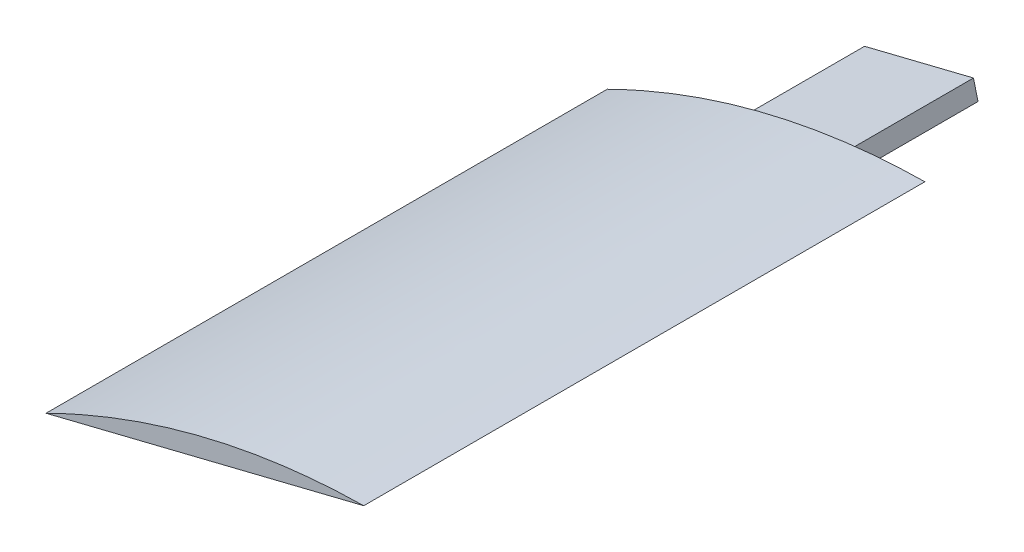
ISO-10303-21;
HEADER;
FILE_DESCRIPTION(('STEP AP214'),'2;1');
FILE_NAME('part.step','',(''),(''),'','','');
FILE_SCHEMA(('AUTOMOTIVE_DESIGN { 1 0 10303 214 1 1 1 1 }'));
ENDSEC;
DATA;
#1=APPLICATION_CONTEXT('core data for automotive mechanical design processes');
#2=APPLICATION_PROTOCOL_DEFINITION('international standard','automotive_design',2000,#1);
#3=PRODUCT_CONTEXT('',#1,'mechanical');
#4=PRODUCT('Part','Part','',(#3));
#5=PRODUCT_RELATED_PRODUCT_CATEGORY('part','',(#4));
#6=PRODUCT_DEFINITION_FORMATION('','',#4);
#7=PRODUCT_DEFINITION_CONTEXT('part definition',#1,'design');
#8=PRODUCT_DEFINITION('design','',#6,#7);
#9=PRODUCT_DEFINITION_SHAPE('','',#8);
#10=(LENGTH_UNIT() NAMED_UNIT(*) SI_UNIT(.MILLI.,.METRE.));
#11=(NAMED_UNIT(*) PLANE_ANGLE_UNIT() SI_UNIT($,.RADIAN.));
#12=(NAMED_UNIT(*) SI_UNIT($,.STERADIAN.) SOLID_ANGLE_UNIT());
#13=UNCERTAINTY_MEASURE_WITH_UNIT(LENGTH_MEASURE(1.E-05),#10,'distance_accuracy_value','');
#14=(GEOMETRIC_REPRESENTATION_CONTEXT(3) GLOBAL_UNCERTAINTY_ASSIGNED_CONTEXT((#13)) GLOBAL_UNIT_ASSIGNED_CONTEXT((#10,
#11,#12)) REPRESENTATION_CONTEXT('',''));
#15=CARTESIAN_POINT('',(0.,0.,0.));
#16=DIRECTION('',(0.,0.,1.));
#17=DIRECTION('',(1.,0.,0.));
#18=AXIS2_PLACEMENT_3D('',#15,#16,#17);
#19=CARTESIAN_POINT('',(0.,0.,300.));
#20=DIRECTION('',(-0.240603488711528,0.970623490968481,0.));
#21=DIRECTION('',(-0.970623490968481,-0.240603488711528,0.));
#22=AXIS2_PLACEMENT_3D('',#19,#20,#21);
#23=PLANE('',#22);
#24=DIRECTION('',(0.,0.,1.));
#25=VECTOR('',#24,1.);
#26=CARTESIAN_POINT('',(123.262330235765,30.5549442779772,-72.5682300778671));
#27=LINE('',#26,#25);
#28=CARTESIAN_POINT('',(123.262330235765,30.5549442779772,0.));
#29=VERTEX_POINT('',#28);
#30=CARTESIAN_POINT('',(123.262330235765,30.5549442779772,67.4317699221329));
#31=VERTEX_POINT('',#30);
#32=EDGE_CURVE('E254',#29,#31,#27,.T.);
#33=ORIENTED_EDGE('',*,*,#32,.F.);
#34=DIRECTION('',(0.970623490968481,0.240603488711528,0.));
#35=VECTOR('',#34,1.);
#36=CARTESIAN_POINT('',(0.,0.,0.));
#37=LINE('',#36,#35);
#38=CARTESIAN_POINT('',(169.859110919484,42.1056105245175,0.));
#39=VERTEX_POINT('',#38);
#40=EDGE_CURVE('E121',#29,#39,#37,.T.);
#41=ORIENTED_EDGE('',*,*,#40,.T.);
#42=DIRECTION('',(0.,0.,-1.));
#43=VECTOR('',#42,1.);
#44=CARTESIAN_POINT('',(169.859110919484,42.1056105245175,300.));
#45=LINE('',#44,#43);
#46=CARTESIAN_POINT('',(169.859110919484,42.1056105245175,300.));
#47=VERTEX_POINT('',#46);
#48=EDGE_CURVE('E42',#47,#39,#45,.T.);
#49=ORIENTED_EDGE('',*,*,#48,.F.);
#50=DIRECTION('',(0.970623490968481,0.240603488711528,0.));
#51=VECTOR('',#50,1.);
#52=CARTESIAN_POINT('',(0.,0.,300.));
#53=LINE('',#52,#51);
#54=CARTESIAN_POINT('',(0.,0.,300.));
#55=VERTEX_POINT('',#54);
#56=EDGE_CURVE('E132',#55,#47,#53,.T.);
#57=ORIENTED_EDGE('',*,*,#56,.F.);
#58=DIRECTION('',(0.,0.,-1.));
#59=VECTOR('',#58,1.);
#60=CARTESIAN_POINT('',(0.,0.,300.));
#61=LINE('',#60,#59);
#62=CARTESIAN_POINT('',(0.,0.,0.));
#63=VERTEX_POINT('',#62);
#64=EDGE_CURVE('E11',#55,#63,#61,.T.);
#65=ORIENTED_EDGE('',*,*,#64,.T.);
#66=CARTESIAN_POINT('',(65.0249207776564,16.1187349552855,0.));
#67=VERTEX_POINT('',#66);
#68=EDGE_CURVE('E133',#63,#67,#37,.T.);
#69=ORIENTED_EDGE('',*,*,#68,.T.);
#70=DIRECTION('',(0.,0.,-1.));
#71=VECTOR('',#70,1.);
#72=CARTESIAN_POINT('',(65.0249207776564,16.1187349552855,67.4317699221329));
#73=LINE('',#72,#71);
#74=CARTESIAN_POINT('',(65.0249207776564,16.1187349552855,67.4317699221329));
#75=VERTEX_POINT('',#74);
#76=EDGE_CURVE('E54',#75,#67,#73,.T.);
#77=ORIENTED_EDGE('',*,*,#76,.F.);
#78=DIRECTION('',(-0.970623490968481,-0.240603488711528,0.));
#79=VECTOR('',#78,1.);
#80=CARTESIAN_POINT('',(94.1436255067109,23.3368396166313,67.4317699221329));
#81=LINE('',#80,#79);
#82=EDGE_CURVE('E49',#31,#75,#81,.T.);
#83=ORIENTED_EDGE('',*,*,#82,.F.);
#84=EDGE_LOOP('',(#33,#41,#49,#57,#65,#69,#77,#83));
#85=FACE_BOUND('',#84,.T.);
#86=ADVANCED_FACE('F33',(#85),#23,.F.);
#87=CARTESIAN_POINT('',(169.859110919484,42.1056105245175,300.));
#88=CARTESIAN_POINT('',(82.5128210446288,40.8466729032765,300.));
#89=CARTESIAN_POINT('',(0.,0.,300.));
#90=B_SPLINE_CURVE_WITH_KNOTS('',2,(#87,#88,#89),.UNSPECIFIED.,.F.,.F.,(3,3),(0.,
0.940200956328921),.UNSPECIFIED.);
#91=DIRECTION('',(0.,0.,-1.));
#92=VECTOR('',#91,1.);
#93=SURFACE_OF_LINEAR_EXTRUSION('',#90,#92);
#94=CARTESIAN_POINT('',(169.859110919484,42.1056105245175,0.));
#95=CARTESIAN_POINT('',(82.5128210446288,40.8466729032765,0.));
#96=CARTESIAN_POINT('',(0.,0.,0.));
#97=B_SPLINE_CURVE_WITH_KNOTS('',2,(#94,#95,#96),.UNSPECIFIED.,.F.,.F.,(3,3),(0.,
0.940200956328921),.UNSPECIFIED.);
#98=EDGE_CURVE('E118',#39,#63,#97,.T.);
#99=ORIENTED_EDGE('',*,*,#98,.T.);
#100=ORIENTED_EDGE('',*,*,#64,.F.);
#101=EDGE_CURVE('E126',#47,#55,#90,.T.);
#102=ORIENTED_EDGE('',*,*,#101,.F.);
#103=ORIENTED_EDGE('',*,*,#48,.T.);
#104=EDGE_LOOP('',(#99,#100,#102,#103));
#105=FACE_BOUND('',#104,.T.);
#106=ADVANCED_FACE('F35',(#105),#93,.F.);
#107=CARTESIAN_POINT('',(83.7211882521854,30.9497390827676,300.));
#108=DIRECTION('',(0.,0.,1.));
#109=DIRECTION('',(1.,0.,0.));
#110=AXIS2_PLACEMENT_3D('',#107,#108,#109);
#111=PLANE('',#110);
#112=ORIENTED_EDGE('',*,*,#101,.T.);
#113=ORIENTED_EDGE('',*,*,#56,.T.);
#114=EDGE_LOOP('',(#112,#113));
#115=FACE_BOUND('',#114,.T.);
#116=ADVANCED_FACE('F155',(#115),#111,.T.);
#117=CARTESIAN_POINT('',(83.7211882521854,30.9497390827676,0.));
#118=DIRECTION('',(0.,0.,1.));
#119=DIRECTION('',(1.,0.,0.));
#120=AXIS2_PLACEMENT_3D('',#117,#118,#119);
#121=PLANE('',#120);
#122=ORIENTED_EDGE('',*,*,#98,.F.);
#123=ORIENTED_EDGE('',*,*,#40,.F.);
#124=EDGE_CURVE('E143',#67,#29,#37,.T.);
#125=ORIENTED_EDGE('',*,*,#124,.F.);
#126=ORIENTED_EDGE('',*,*,#68,.F.);
#127=EDGE_LOOP('',(#122,#123,#125,#126));
#128=FACE_BOUND('',#127,.T.);
#129=ADVANCED_FACE('F151',(#128),#121,.F.);
#130=CARTESIAN_POINT('',(123.262330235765,30.5549442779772,-72.5682300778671));
#131=DIRECTION('',(0.240603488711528,-0.970623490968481,0.));
#132=DIRECTION('',(0.970623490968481,0.240603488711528,0.));
#133=AXIS2_PLACEMENT_3D('',#130,#131,#132);
#134=PLANE('',#133);
#135=CARTESIAN_POINT('',(65.0249207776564,16.1187349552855,-72.5682300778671));
#136=VERTEX_POINT('',#135);
#137=EDGE_CURVE('E244',#67,#136,#73,.T.);
#138=ORIENTED_EDGE('',*,*,#137,.F.);
#139=ORIENTED_EDGE('',*,*,#124,.T.);
#140=CARTESIAN_POINT('',(123.262330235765,30.5549442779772,-72.5682300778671));
#141=VERTEX_POINT('',#140);
#142=EDGE_CURVE('E255',#141,#29,#27,.T.);
#143=ORIENTED_EDGE('',*,*,#142,.F.);
#144=DIRECTION('',(0.970623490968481,0.240603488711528,0.));
#145=VECTOR('',#144,1.);
#146=CARTESIAN_POINT('',(65.0249207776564,16.1187349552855,-72.5682300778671));
#147=LINE('',#146,#145);
#148=EDGE_CURVE('E117',#136,#141,#147,.T.);
#149=ORIENTED_EDGE('',*,*,#148,.F.);
#150=EDGE_LOOP('',(#138,#139,#143,#149));
#151=FACE_BOUND('',#150,.T.);
#152=ADVANCED_FACE('F162',(#151),#134,.F.);
#153=CARTESIAN_POINT('',(67.4309556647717,6.41250004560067,-72.5682300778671));
#154=DIRECTION('',(0.,0.,1.));
#155=DIRECTION('',(1.,0.,0.));
#156=AXIS2_PLACEMENT_3D('',#153,#154,#155);
#157=PLANE('',#156);
#158=ORIENTED_EDGE('',*,*,#148,.T.);
#159=DIRECTION('',(-0.240603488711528,0.970623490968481,0.));
#160=VECTOR('',#159,1.);
#161=CARTESIAN_POINT('',(125.668365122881,20.8487093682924,-72.5682300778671));
#162=LINE('',#161,#160);
#163=CARTESIAN_POINT('',(125.668365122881,20.8487093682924,-72.5682300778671));
#164=VERTEX_POINT('',#163);
#165=EDGE_CURVE('E98',#164,#141,#162,.T.);
#166=ORIENTED_EDGE('',*,*,#165,.F.);
#167=DIRECTION('',(0.970623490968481,0.240603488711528,0.));
#168=VECTOR('',#167,1.);
#169=CARTESIAN_POINT('',(67.4309556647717,6.41250004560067,-72.5682300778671));
#170=LINE('',#169,#168);
#171=CARTESIAN_POINT('',(67.4309556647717,6.41250004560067,-72.5682300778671));
#172=VERTEX_POINT('',#171);
#173=EDGE_CURVE('E105',#172,#164,#170,.T.);
#174=ORIENTED_EDGE('',*,*,#173,.F.);
#175=DIRECTION('',(-0.240603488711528,0.970623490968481,0.));
#176=VECTOR('',#175,1.);
#177=CARTESIAN_POINT('',(67.4309556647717,6.41250004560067,-72.5682300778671));
#178=LINE('',#177,#176);
#179=EDGE_CURVE('E250',#172,#136,#178,.T.);
#180=ORIENTED_EDGE('',*,*,#179,.T.);
#181=EDGE_LOOP('',(#158,#166,#174,#180));
#182=FACE_BOUND('',#181,.T.);
#183=ADVANCED_FACE('F115',(#182),#157,.F.);
#184=CARTESIAN_POINT('',(125.668365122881,20.8487093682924,-72.5682300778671));
#185=DIRECTION('',(-0.970623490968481,-0.240603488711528,0.));
#186=DIRECTION('',(0.240603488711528,-0.970623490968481,0.));
#187=AXIS2_PLACEMENT_3D('',#184,#185,#186);
#188=PLANE('',#187);
#189=ORIENTED_EDGE('',*,*,#142,.T.);
#190=ORIENTED_EDGE('',*,*,#32,.T.);
#191=DIRECTION('',(-0.240603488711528,0.970623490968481,0.));
#192=VECTOR('',#191,1.);
#193=CARTESIAN_POINT('',(125.668365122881,20.8487093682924,67.4317699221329));
#194=LINE('',#193,#192);
#195=CARTESIAN_POINT('',(125.668365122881,20.8487093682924,67.4317699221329));
#196=VERTEX_POINT('',#195);
#197=EDGE_CURVE('E101',#196,#31,#194,.T.);
#198=ORIENTED_EDGE('',*,*,#197,.F.);
#199=DIRECTION('',(0.,0.,1.));
#200=VECTOR('',#199,1.);
#201=CARTESIAN_POINT('',(125.668365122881,20.8487093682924,-72.5682300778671));
#202=LINE('',#201,#200);
#203=EDGE_CURVE('E93',#164,#196,#202,.T.);
#204=ORIENTED_EDGE('',*,*,#203,.F.);
#205=ORIENTED_EDGE('',*,*,#165,.T.);
#206=EDGE_LOOP('',(#189,#190,#198,#204,#205));
#207=FACE_BOUND('',#206,.T.);
#208=ADVANCED_FACE('F96',(#207),#188,.F.);
#209=CARTESIAN_POINT('',(96.5496603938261,13.6306047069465,67.4317699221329));
#210=DIRECTION('',(0.,0.,-1.));
#211=DIRECTION('',(-1.,0.,0.));
#212=AXIS2_PLACEMENT_3D('',#209,#210,#211);
#213=PLANE('',#212);
#214=ORIENTED_EDGE('',*,*,#82,.T.);
#215=DIRECTION('',(-0.240603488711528,0.970623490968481,0.));
#216=VECTOR('',#215,1.);
#217=CARTESIAN_POINT('',(67.4309556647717,6.41250004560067,67.4317699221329));
#218=LINE('',#217,#216);
#219=CARTESIAN_POINT('',(67.4309556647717,6.41250004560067,67.4317699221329));
#220=VERTEX_POINT('',#219);
#221=EDGE_CURVE('E123',#220,#75,#218,.T.);
#222=ORIENTED_EDGE('',*,*,#221,.F.);
#223=DIRECTION('',(-0.970623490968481,-0.240603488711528,0.));
#224=VECTOR('',#223,1.);
#225=CARTESIAN_POINT('',(96.5496603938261,13.6306047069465,67.4317699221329));
#226=LINE('',#225,#224);
#227=EDGE_CURVE('E104',#196,#220,#226,.T.);
#228=ORIENTED_EDGE('',*,*,#227,.F.);
#229=ORIENTED_EDGE('',*,*,#197,.T.);
#230=EDGE_LOOP('',(#214,#222,#228,#229));
#231=FACE_BOUND('',#230,.T.);
#232=ADVANCED_FACE('F207',(#231),#213,.F.);
#233=CARTESIAN_POINT('',(67.4309556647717,6.41250004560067,67.4317699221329));
#234=DIRECTION('',(0.970623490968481,0.240603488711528,0.));
#235=DIRECTION('',(-0.240603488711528,0.970623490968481,0.));
#236=AXIS2_PLACEMENT_3D('',#233,#234,#235);
#237=PLANE('',#236);
#238=ORIENTED_EDGE('',*,*,#76,.T.);
#239=ORIENTED_EDGE('',*,*,#137,.T.);
#240=ORIENTED_EDGE('',*,*,#179,.F.);
#241=DIRECTION('',(0.,0.,-1.));
#242=VECTOR('',#241,1.);
#243=CARTESIAN_POINT('',(67.4309556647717,6.41250004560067,67.4317699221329));
#244=LINE('',#243,#242);
#245=EDGE_CURVE('E110',#220,#172,#244,.T.);
#246=ORIENTED_EDGE('',*,*,#245,.F.);
#247=ORIENTED_EDGE('',*,*,#221,.T.);
#248=EDGE_LOOP('',(#238,#239,#240,#246,#247));
#249=FACE_BOUND('',#248,.T.);
#250=ADVANCED_FACE('F215',(#249),#237,.F.);
#251=CARTESIAN_POINT('',(125.668365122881,20.8487093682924,-72.5682300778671));
#252=DIRECTION('',(0.240603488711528,-0.970623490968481,0.));
#253=DIRECTION('',(0.970623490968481,0.240603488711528,0.));
#254=AXIS2_PLACEMENT_3D('',#251,#252,#253);
#255=PLANE('',#254);
#256=ORIENTED_EDGE('',*,*,#173,.T.);
#257=ORIENTED_EDGE('',*,*,#203,.T.);
#258=ORIENTED_EDGE('',*,*,#227,.T.);
#259=ORIENTED_EDGE('',*,*,#245,.T.);
#260=EDGE_LOOP('',(#256,#257,#258,#259));
#261=FACE_BOUND('',#260,.T.);
#262=ADVANCED_FACE('F108',(#261),#255,.T.);
#263=CLOSED_SHELL('',(#86,#106,#116,#129,#152,#183,#208,#232,#250,#262));
#264=MANIFOLD_SOLID_BREP('B2',#263);
#265=ADVANCED_BREP_SHAPE_REPRESENTATION('',(#18,#264),#14);
#266=SHAPE_DEFINITION_REPRESENTATION(#9,#265);
ENDSEC;
END-ISO-10303-21;
